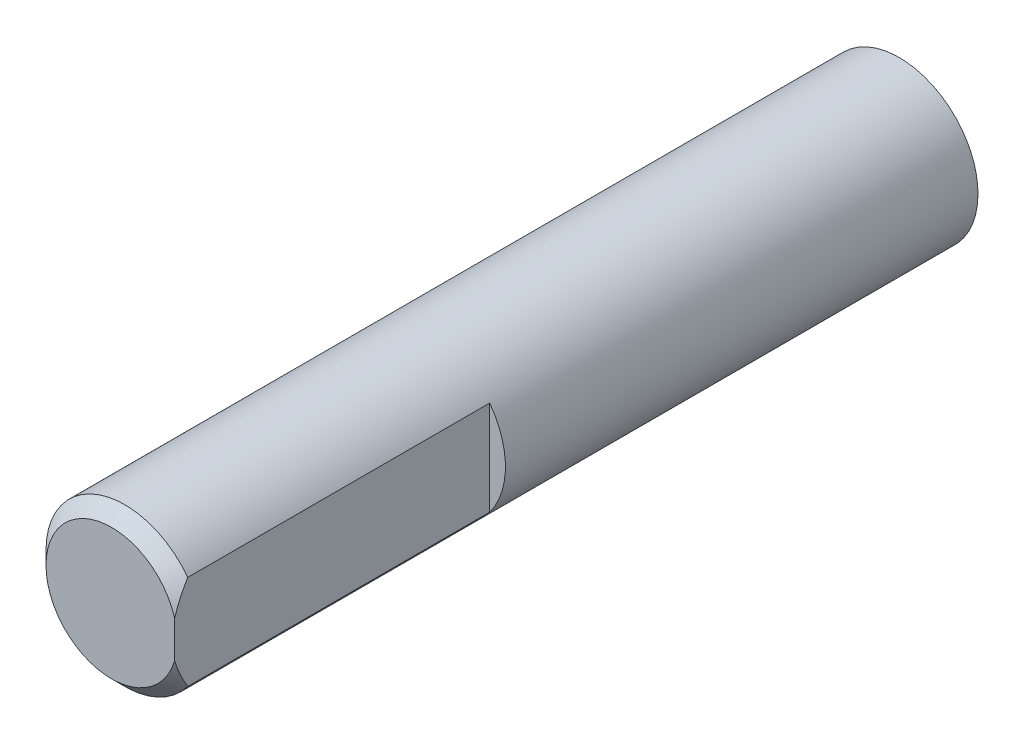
ISO-10303-21;
HEADER;
FILE_DESCRIPTION(('STEP AP214'),'2;1');
FILE_NAME('part.step','',(''),(''),'','','');
FILE_SCHEMA(('AUTOMOTIVE_DESIGN { 1 0 10303 214 1 1 1 1 }'));
ENDSEC;
DATA;
#1=APPLICATION_CONTEXT('core data for automotive mechanical design processes');
#2=APPLICATION_PROTOCOL_DEFINITION('international standard','automotive_design',2000,#1);
#3=PRODUCT_CONTEXT('',#1,'mechanical');
#4=PRODUCT('Part','Part','',(#3));
#5=PRODUCT_RELATED_PRODUCT_CATEGORY('part','',(#4));
#6=PRODUCT_DEFINITION_FORMATION('','',#4);
#7=PRODUCT_DEFINITION_CONTEXT('part definition',#1,'design');
#8=PRODUCT_DEFINITION('design','',#6,#7);
#9=PRODUCT_DEFINITION_SHAPE('','',#8);
#10=(LENGTH_UNIT() NAMED_UNIT(*) SI_UNIT(.MILLI.,.METRE.));
#11=(NAMED_UNIT(*) PLANE_ANGLE_UNIT() SI_UNIT($,.RADIAN.));
#12=(NAMED_UNIT(*) SI_UNIT($,.STERADIAN.) SOLID_ANGLE_UNIT());
#13=UNCERTAINTY_MEASURE_WITH_UNIT(LENGTH_MEASURE(1.E-05),#10,'distance_accuracy_value','');
#14=(GEOMETRIC_REPRESENTATION_CONTEXT(3) GLOBAL_UNCERTAINTY_ASSIGNED_CONTEXT((#13)) GLOBAL_UNIT_ASSIGNED_CONTEXT((#10,
#11,#12)) REPRESENTATION_CONTEXT('',''));
#15=CARTESIAN_POINT('',(0.,0.,0.));
#16=DIRECTION('',(0.,0.,1.));
#17=DIRECTION('',(1.,0.,0.));
#18=AXIS2_PLACEMENT_3D('',#15,#16,#17);
#19=CARTESIAN_POINT('',(0.,0.,30.));
#20=DIRECTION('',(0.,0.,-1.));
#21=DIRECTION('',(-1.,0.,0.));
#22=AXIS2_PLACEMENT_3D('',#19,#20,#21);
#23=CYLINDRICAL_SURFACE('',#22,3.);
#24=CARTESIAN_POINT('',(0.,0.,29.5));
#25=DIRECTION('',(0.,0.,1.));
#26=DIRECTION('',(1.,0.,0.));
#27=AXIS2_PLACEMENT_3D('',#24,#25,#26);
#28=CIRCLE('',#27,3.);
#29=CARTESIAN_POINT('',(2.4,-1.8,29.5));
#30=VERTEX_POINT('',#29);
#31=CARTESIAN_POINT('',(2.4,1.8,29.5));
#32=VERTEX_POINT('',#31);
#33=EDGE_CURVE('E77',#30,#32,#28,.F.);
#34=ORIENTED_EDGE('',*,*,#33,.T.);
#35=DIRECTION('',(0.,0.,-1.));
#36=VECTOR('',#35,1.);
#37=CARTESIAN_POINT('',(2.4,1.8,30.));
#38=LINE('',#37,#36);
#39=CARTESIAN_POINT('',(2.4,1.8,18.));
#40=VERTEX_POINT('',#39);
#41=EDGE_CURVE('E55',#32,#40,#38,.T.);
#42=ORIENTED_EDGE('',*,*,#41,.T.);
#43=CARTESIAN_POINT('',(0.,0.,18.));
#44=DIRECTION('',(0.,0.,1.));
#45=DIRECTION('',(1.,0.,0.));
#46=AXIS2_PLACEMENT_3D('',#43,#44,#45);
#47=CIRCLE('',#46,3.);
#48=CARTESIAN_POINT('',(2.4,-1.8,18.));
#49=VERTEX_POINT('',#48);
#50=EDGE_CURVE('E11',#49,#40,#47,.T.);
#51=ORIENTED_EDGE('',*,*,#50,.F.);
#52=DIRECTION('',(0.,0.,-1.));
#53=VECTOR('',#52,1.);
#54=CARTESIAN_POINT('',(2.4,-1.8,30.));
#55=LINE('',#54,#53);
#56=EDGE_CURVE('E106',#49,#30,#55,.F.);
#57=ORIENTED_EDGE('',*,*,#56,.T.);
#58=EDGE_LOOP('',(#34,#42,#51,#57));
#59=FACE_BOUND('',#58,.T.);
#60=CARTESIAN_POINT('',(0.,0.,0.));
#61=DIRECTION('',(0.,0.,1.));
#62=DIRECTION('',(1.,0.,0.));
#63=AXIS2_PLACEMENT_3D('',#60,#61,#62);
#64=CIRCLE('',#63,3.);
#65=CARTESIAN_POINT('',(3.,0.,0.));
#66=VERTEX_POINT('',#65);
#67=EDGE_CURVE('E78',#66,#66,#64,.T.);
#68=ORIENTED_EDGE('',*,*,#67,.T.);
#69=EDGE_LOOP('',(#68));
#70=FACE_BOUND('',#69,.T.);
#71=ADVANCED_FACE('F33',(#59,#70),#23,.T.);
#72=CARTESIAN_POINT('',(0.,0.,30.));
#73=DIRECTION('',(0.,0.,1.));
#74=DIRECTION('',(1.,0.,0.));
#75=AXIS2_PLACEMENT_3D('',#72,#73,#74);
#76=PLANE('',#75);
#77=DIRECTION('',(0.,-1.,0.));
#78=VECTOR('',#77,1.);
#79=CARTESIAN_POINT('',(2.4,2.5,30.));
#80=LINE('',#79,#78);
#81=CARTESIAN_POINT('',(2.4,0.700000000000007,30.));
#82=VERTEX_POINT('',#81);
#83=CARTESIAN_POINT('',(2.4,-0.700000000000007,30.));
#84=VERTEX_POINT('',#83);
#85=EDGE_CURVE('E49',#82,#84,#80,.T.);
#86=ORIENTED_EDGE('',*,*,#85,.F.);
#87=CARTESIAN_POINT('',(0.,0.,30.));
#88=DIRECTION('',(0.,0.,1.));
#89=DIRECTION('',(1.,0.,0.));
#90=AXIS2_PLACEMENT_3D('',#87,#88,#89);
#91=CIRCLE('',#90,2.5);
#92=EDGE_CURVE('E74',#82,#84,#91,.T.);
#93=ORIENTED_EDGE('',*,*,#92,.T.);
#94=EDGE_LOOP('',(#86,#93));
#95=FACE_BOUND('',#94,.T.);
#96=ADVANCED_FACE('F73',(#95),#76,.T.);
#97=CARTESIAN_POINT('',(0.,0.,0.));
#98=DIRECTION('',(0.,0.,1.));
#99=DIRECTION('',(1.,0.,0.));
#100=AXIS2_PLACEMENT_3D('',#97,#98,#99);
#101=PLANE('',#100);
#102=ORIENTED_EDGE('',*,*,#67,.F.);
#103=EDGE_LOOP('',(#102));
#104=FACE_BOUND('',#103,.T.);
#105=ADVANCED_FACE('F95',(#104),#101,.F.);
#106=CARTESIAN_POINT('',(0.,0.,30.));
#107=DIRECTION('',(0.,0.,-1.));
#108=DIRECTION('',(-1.,0.,0.));
#109=AXIS2_PLACEMENT_3D('',#106,#107,#108);
#110=CONICAL_SURFACE('',#109,2.5,0.78539816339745);
#111=CARTESIAN_POINT('',(2.4,5.51516268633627,26.4852664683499));
#112=CARTESIAN_POINT('',(2.4,5.35242016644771,26.6344473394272));
#113=CARTESIAN_POINT('',(2.4,5.1891921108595,26.783106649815));
#114=CARTESIAN_POINT('',(2.4,4.86135039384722,27.0789669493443));
#115=CARTESIAN_POINT('',(2.4,4.69673641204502,27.2261675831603));
#116=CARTESIAN_POINT('',(2.4,4.36470363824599,27.5195798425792));
#117=CARTESIAN_POINT('',(2.4,4.19727354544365,27.6657787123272));
#118=CARTESIAN_POINT('',(2.4,3.86010129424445,27.9554532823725));
#119=CARTESIAN_POINT('',(2.4,3.69035942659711,28.098929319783));
#120=CARTESIAN_POINT('',(2.4,3.37682755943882,28.3579530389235));
#121=CARTESIAN_POINT('',(2.4,3.23353453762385,28.4740999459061));
#122=CARTESIAN_POINT('',(2.4,2.94404194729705,28.7027005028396));
#123=CARTESIAN_POINT('',(2.4,2.79784263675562,28.8151544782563));
#124=CARTESIAN_POINT('',(2.4,2.50165275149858,29.0346950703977));
#125=CARTESIAN_POINT('',(2.4,2.35166631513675,29.1417871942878));
#126=CARTESIAN_POINT('',(2.4,2.1226927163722,29.2964562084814));
#127=CARTESIAN_POINT('',(2.4,2.04571788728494,29.3470084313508));
#128=CARTESIAN_POINT('',(2.4,1.890195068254,29.4456241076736));
#129=CARTESIAN_POINT('',(2.4,1.81164727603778,29.4936878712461));
#130=CARTESIAN_POINT('',(2.4,1.65378030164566,29.5860767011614));
#131=CARTESIAN_POINT('',(2.4,1.5744854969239,29.6304431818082));
#132=CARTESIAN_POINT('',(2.4,1.41387255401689,29.7153297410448));
#133=CARTESIAN_POINT('',(2.4,1.3325549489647,29.7558508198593));
#134=CARTESIAN_POINT('',(2.4,1.16773653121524,29.8319908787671));
#135=CARTESIAN_POINT('',(2.4,1.08423806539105,29.8676148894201));
#136=CARTESIAN_POINT('',(2.4,0.914869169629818,29.9327284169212));
#137=CARTESIAN_POINT('',(2.4,0.828999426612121,29.9622196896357));
#138=CARTESIAN_POINT('',(2.4,0.672761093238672,30.0083672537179));
#139=CARTESIAN_POINT('',(2.4,0.602805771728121,30.0264146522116));
#140=CARTESIAN_POINT('',(2.4,0.461700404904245,30.0569631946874));
#141=CARTESIAN_POINT('',(2.4,0.390550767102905,30.069466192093));
#142=CARTESIAN_POINT('',(2.4,0.247609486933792,30.0882979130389));
#143=CARTESIAN_POINT('',(2.4,0.175819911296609,30.0946420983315));
#144=CARTESIAN_POINT('',(2.4,0.0319577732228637,30.1008629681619));
#145=CARTESIAN_POINT('',(2.4,-0.040114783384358,30.1007397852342));
#146=CARTESIAN_POINT('',(2.4,-0.18393885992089,30.0940338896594));
#147=CARTESIAN_POINT('',(2.4,-0.255690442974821,30.0874525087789));
#148=CARTESIAN_POINT('',(2.4,-0.398372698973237,30.0681900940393));
#149=CARTESIAN_POINT('',(2.4,-0.469303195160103,30.0555077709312));
#150=CARTESIAN_POINT('',(2.4,-0.610146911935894,30.0246129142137));
#151=CARTESIAN_POINT('',(2.4,-0.680056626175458,30.0063846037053));
#152=CARTESIAN_POINT('',(2.4,-0.818433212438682,29.9651492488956));
#153=CARTESIAN_POINT('',(2.4,-0.886900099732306,29.9421422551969));
#154=CARTESIAN_POINT('',(2.4,-1.03850294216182,29.8861124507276));
#155=CARTESIAN_POINT('',(2.4,-1.1212375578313,29.8520098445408));
#156=CARTESIAN_POINT('',(2.4,-1.28450460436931,29.7788565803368));
#157=CARTESIAN_POINT('',(2.4,-1.36503600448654,29.7398036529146));
#158=CARTESIAN_POINT('',(2.4,-1.52420751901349,29.6577211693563));
#159=CARTESIAN_POINT('',(2.4,-1.60284411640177,29.6146848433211));
#160=CARTESIAN_POINT('',(2.4,-1.758335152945,29.5254921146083));
#161=CARTESIAN_POINT('',(2.4,-1.83518923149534,29.479335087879));
#162=CARTESIAN_POINT('',(2.4,-2.06504199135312,29.3361658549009));
#163=CARTESIAN_POINT('',(2.4,-2.21566565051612,29.2353480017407));
#164=CARTESIAN_POINT('',(2.4,-2.51232017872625,29.0271561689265));
#165=CARTESIAN_POINT('',(2.4,-2.65834912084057,28.9197794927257));
#166=CARTESIAN_POINT('',(2.4,-2.92371922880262,28.7182066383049));
#167=CARTESIAN_POINT('',(2.4,-3.04356822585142,28.6246755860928));
#168=CARTESIAN_POINT('',(2.4,-3.28137588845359,28.4352414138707));
#169=CARTESIAN_POINT('',(2.4,-3.39933449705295,28.3393382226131));
#170=CARTESIAN_POINT('',(2.4,-3.63381859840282,28.1456607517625));
#171=CARTESIAN_POINT('',(2.4,-3.75034320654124,28.0478854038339));
#172=CARTESIAN_POINT('',(2.4,-3.98218545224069,27.8509059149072));
#173=CARTESIAN_POINT('',(2.4,-4.09750303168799,27.7517017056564));
#174=CARTESIAN_POINT('',(2.4,-4.43249506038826,27.4606490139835));
#175=CARTESIAN_POINT('',(2.4,-4.65086072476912,27.2672944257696));
#176=CARTESIAN_POINT('',(2.4,-4.97640490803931,26.9752964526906));
#177=CARTESIAN_POINT('',(2.4,-5.08452303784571,26.8776936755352));
#178=CARTESIAN_POINT('',(2.4,-5.30022293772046,26.6818977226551));
#179=CARTESIAN_POINT('',(2.4,-5.40780470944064,26.5837045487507));
#180=CARTESIAN_POINT('',(2.4,-5.51516268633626,26.4852664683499));
#181=B_SPLINE_CURVE_WITH_KNOTS('',3,(#111,#112,#113,#114,#115,#116,#117,#118,#119,#120,#121,
#122,#123,#124,#125,#126,#127,#128,#129,#130,#131,#132,#133,#134,#135,#136,#137,#138,#139,#140,
#141,#142,#143,#144,#145,#146,#147,#148,#149,#150,#151,#152,#153,#154,#155,#156,#157,#158,#159,
#160,#161,#162,#163,#164,#165,#166,#167,#168,#169,#170,#171,#172,#173,#174,#175,#176,#177,#178,
#179,#180),.UNSPECIFIED.,.F.,.F.,(4,2,2,2,2,2,2,2,2,2,2,2,2,2,2,2,2,2,2,2,2,2,2,2,2,2,2,2,2,2,2,
2,2,2,4),(0.,0.662321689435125,1.32480093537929,1.99161091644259,2.65833779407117,
3.2116528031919,3.76491891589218,4.31760459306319,4.5938399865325,4.8700408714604,
5.14254673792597,5.41498152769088,5.68713433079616,5.95920910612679,6.17575349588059,
6.39222544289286,6.6081525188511,6.82407516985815,7.0399533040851,7.25587707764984,
7.47242093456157,7.68896249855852,7.95721368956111,8.22558830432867,8.49442771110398,
8.76332103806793,9.30676383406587,9.85043158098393,10.3064704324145,10.7625229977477,
11.2188440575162,11.6751869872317,12.5501443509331,12.9871130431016,13.4240803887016),.UNSPECIFIED.);
#182=EDGE_CURVE('E42',#32,#82,#181,.T.);
#183=ORIENTED_EDGE('',*,*,#182,.F.);
#184=ORIENTED_EDGE('',*,*,#33,.F.);
#185=EDGE_CURVE('E70',#84,#30,#181,.T.);
#186=ORIENTED_EDGE('',*,*,#185,.F.);
#187=ORIENTED_EDGE('',*,*,#92,.F.);
#188=EDGE_LOOP('',(#183,#184,#186,#187));
#189=FACE_BOUND('',#188,.T.);
#190=ADVANCED_FACE('F35',(#189),#110,.T.);
#191=CARTESIAN_POINT('',(0.,0.,18.));
#192=DIRECTION('',(0.,0.,1.));
#193=DIRECTION('',(1.,0.,0.));
#194=AXIS2_PLACEMENT_3D('',#191,#192,#193);
#195=PLANE('',#194);
#196=ORIENTED_EDGE('',*,*,#50,.T.);
#197=DIRECTION('',(0.,-1.,0.));
#198=VECTOR('',#197,1.);
#199=CARTESIAN_POINT('',(2.4,2.5,18.));
#200=LINE('',#199,#198);
#201=EDGE_CURVE('E75',#40,#49,#200,.T.);
#202=ORIENTED_EDGE('',*,*,#201,.T.);
#203=EDGE_LOOP('',(#196,#202));
#204=FACE_BOUND('',#203,.T.);
#205=ADVANCED_FACE('F92',(#204),#195,.T.);
#206=CARTESIAN_POINT('',(2.4,2.5,18.));
#207=DIRECTION('',(-1.,0.,0.));
#208=DIRECTION('',(0.,-1.,0.));
#209=AXIS2_PLACEMENT_3D('',#206,#207,#208);
#210=PLANE('',#209);
#211=ORIENTED_EDGE('',*,*,#182,.T.);
#212=ORIENTED_EDGE('',*,*,#85,.T.);
#213=ORIENTED_EDGE('',*,*,#185,.T.);
#214=ORIENTED_EDGE('',*,*,#56,.F.);
#215=ORIENTED_EDGE('',*,*,#201,.F.);
#216=ORIENTED_EDGE('',*,*,#41,.F.);
#217=EDGE_LOOP('',(#211,#212,#213,#214,#215,#216));
#218=FACE_BOUND('',#217,.T.);
#219=ADVANCED_FACE('F65',(#218),#210,.F.);
#220=CLOSED_SHELL('',(#71,#96,#105,#190,#205,#219));
#221=MANIFOLD_SOLID_BREP('B2',#220);
#222=ADVANCED_BREP_SHAPE_REPRESENTATION('',(#18,#221),#14);
#223=SHAPE_DEFINITION_REPRESENTATION(#9,#222);
ENDSEC;
END-ISO-10303-21;
